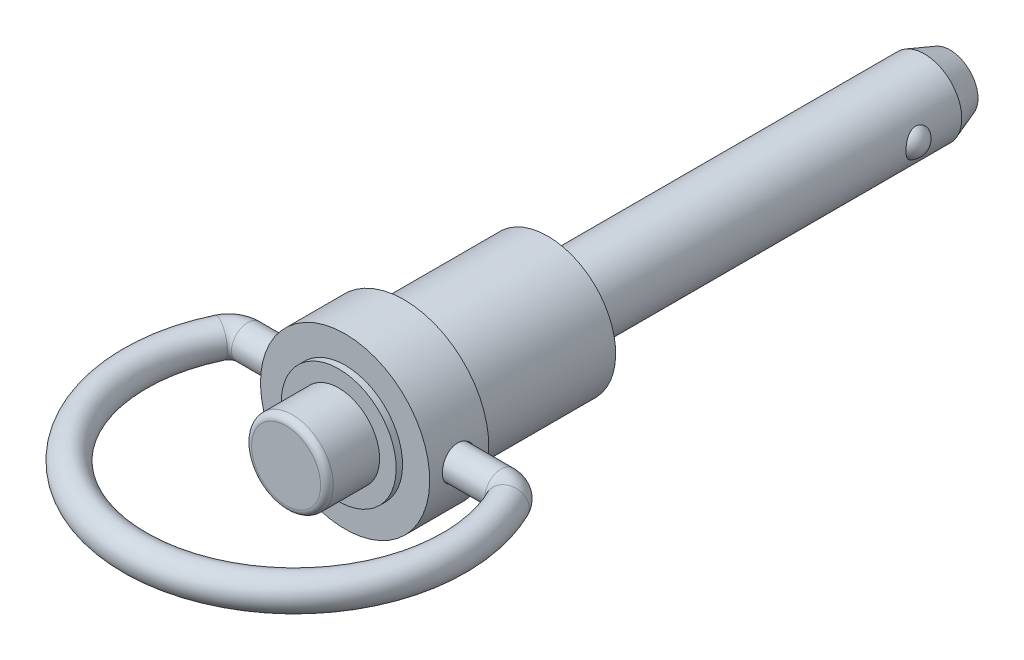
ISO-10303-21;
HEADER;
FILE_DESCRIPTION(('STEP AP214'),'2;1');
FILE_NAME('part.step','',(''),(''),'','','');
FILE_SCHEMA(('AUTOMOTIVE_DESIGN { 1 0 10303 214 1 1 1 1 }'));
ENDSEC;
DATA;
#1=APPLICATION_CONTEXT('core data for automotive mechanical design processes');
#2=APPLICATION_PROTOCOL_DEFINITION('international standard','automotive_design',2000,#1);
#3=PRODUCT_CONTEXT('',#1,'mechanical');
#4=PRODUCT('Part','Part','',(#3));
#5=PRODUCT_RELATED_PRODUCT_CATEGORY('part','',(#4));
#6=PRODUCT_DEFINITION_FORMATION('','',#4);
#7=PRODUCT_DEFINITION_CONTEXT('part definition',#1,'design');
#8=PRODUCT_DEFINITION('design','',#6,#7);
#9=PRODUCT_DEFINITION_SHAPE('','',#8);
#10=(LENGTH_UNIT() NAMED_UNIT(*) SI_UNIT(.MILLI.,.METRE.));
#11=(NAMED_UNIT(*) PLANE_ANGLE_UNIT() SI_UNIT($,.RADIAN.));
#12=(NAMED_UNIT(*) SI_UNIT($,.STERADIAN.) SOLID_ANGLE_UNIT());
#13=UNCERTAINTY_MEASURE_WITH_UNIT(LENGTH_MEASURE(1.E-05),#10,'distance_accuracy_value','');
#14=(GEOMETRIC_REPRESENTATION_CONTEXT(3) GLOBAL_UNCERTAINTY_ASSIGNED_CONTEXT((#13)) GLOBAL_UNIT_ASSIGNED_CONTEXT((#10,
#11,#12)) REPRESENTATION_CONTEXT('',''));
#15=CARTESIAN_POINT('',(0.,0.,0.));
#16=DIRECTION('',(0.,0.,1.));
#17=DIRECTION('',(1.,0.,0.));
#18=AXIS2_PLACEMENT_3D('',#15,#16,#17);
#19=CARTESIAN_POINT('',(0.,0.,-10.));
#20=DIRECTION('',(0.,0.,1.));
#21=DIRECTION('',(-0.810321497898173,-0.585985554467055,0.));
#22=AXIS2_PLACEMENT_3D('',#19,#20,#21);
#23=CYLINDRICAL_SURFACE('',#22,2.969895);
#24=CARTESIAN_POINT('',(0.,0.,0.));
#25=DIRECTION('',(0.,0.,-1.));
#26=DIRECTION('',(0.810321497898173,0.585985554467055,0.));
#27=AXIS2_PLACEMENT_3D('',#24,#25,#26);
#28=CIRCLE('',#27,2.969895);
#29=CARTESIAN_POINT('',(2.40656976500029,1.74031556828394,0.));
#30=VERTEX_POINT('',#29);
#31=EDGE_CURVE('E9',#30,#30,#28,.T.);
#32=ORIENTED_EDGE('',*,*,#31,.T.);
#33=EDGE_LOOP('',(#32));
#34=FACE_BOUND('',#33,.T.);
#35=CARTESIAN_POINT('',(0.,0.,-29.9644));
#36=DIRECTION('',(0.,0.,1.));
#37=DIRECTION('',(0.,-1.,0.));
#38=AXIS2_PLACEMENT_3D('',#35,#36,#37);
#39=CIRCLE('',#38,2.969895);
#40=CARTESIAN_POINT('',(0.,-2.969895,-29.9644));
#41=VERTEX_POINT('',#40);
#42=EDGE_CURVE('E270',#41,#41,#39,.T.);
#43=ORIENTED_EDGE('',*,*,#42,.T.);
#44=EDGE_LOOP('',(#43));
#45=FACE_BOUND('',#44,.T.);
#46=CARTESIAN_POINT('',(-2.969895,0.,-25.5227726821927));
#47=CARTESIAN_POINT('',(-2.96989215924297,-0.0648782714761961,-25.5227743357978));
#48=CARTESIAN_POINT('',(-2.96774890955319,-0.129810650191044,-25.5277431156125));
#49=CARTESIAN_POINT('',(-2.95937136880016,-0.257939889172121,-25.5476001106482));
#50=CARTESIAN_POINT('',(-2.95313126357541,-0.321134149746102,-25.5625024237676));
#51=CARTESIAN_POINT('',(-2.9371782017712,-0.443953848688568,-25.602129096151));
#52=CARTESIAN_POINT('',(-2.92746355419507,-0.503577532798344,-25.6268582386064));
#53=CARTESIAN_POINT('',(-2.90559229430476,-0.617388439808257,-25.6859024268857));
#54=CARTESIAN_POINT('',(-2.89343626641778,-0.671576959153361,-25.720215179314));
#55=CARTESIAN_POINT('',(-2.86839896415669,-0.771461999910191,-25.7970531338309));
#56=CARTESIAN_POINT('',(-2.85554234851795,-0.817332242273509,-25.8393595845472));
#57=CARTESIAN_POINT('',(-2.83045508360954,-0.900380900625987,-25.9319696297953));
#58=CARTESIAN_POINT('',(-2.8182241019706,-0.937563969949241,-25.9822689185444));
#59=CARTESIAN_POINT('',(-2.79711253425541,-0.998697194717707,-26.0848948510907));
#60=CARTESIAN_POINT('',(-2.78803232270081,-1.02352115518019,-26.1366580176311));
#61=CARTESIAN_POINT('',(-2.77311559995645,-1.06327998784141,-26.2442814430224));
#62=CARTESIAN_POINT('',(-2.76727569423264,-1.07822521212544,-26.3001373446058));
#63=CARTESIAN_POINT('',(-2.76016046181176,-1.09629924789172,-26.4072797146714));
#64=CARTESIAN_POINT('',(-2.75843254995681,-1.10060201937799,-26.4583402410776));
#65=CARTESIAN_POINT('',(-2.75840791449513,-1.10066500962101,-26.5604602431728));
#66=CARTESIAN_POINT('',(-2.76011003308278,-1.09642811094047,-26.6115197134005));
#67=CARTESIAN_POINT('',(-2.7665389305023,-1.08009599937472,-26.7091745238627));
#68=CARTESIAN_POINT('',(-2.77108985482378,-1.06845708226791,-26.7558592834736));
#69=CARTESIAN_POINT('',(-2.78255728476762,-1.03822483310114,-26.8466019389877));
#70=CARTESIAN_POINT('',(-2.78947408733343,-1.01963062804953,-26.8906595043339));
#71=CARTESIAN_POINT('',(-2.80532470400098,-0.975195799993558,-26.9770275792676));
#72=CARTESIAN_POINT('',(-2.81433263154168,-0.949077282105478,-27.0191808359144));
#73=CARTESIAN_POINT('',(-2.83331083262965,-0.890821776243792,-27.098843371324));
#74=CARTESIAN_POINT('',(-2.84328141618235,-0.858682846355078,-27.1363511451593));
#75=CARTESIAN_POINT('',(-2.86436272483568,-0.785676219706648,-27.2098152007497));
#76=CARTESIAN_POINT('',(-2.87548504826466,-0.744250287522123,-27.2452131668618));
#77=CARTESIAN_POINT('',(-2.89682746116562,-0.656290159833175,-27.3093141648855));
#78=CARTESIAN_POINT('',(-2.907046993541,-0.609752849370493,-27.338013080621));
#79=CARTESIAN_POINT('',(-2.92666611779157,-0.507798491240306,-27.3910016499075));
#80=CARTESIAN_POINT('',(-2.93587767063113,-0.45195949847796,-27.4145497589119));
#81=CARTESIAN_POINT('',(-2.95127762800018,-0.337032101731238,-27.4529672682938));
#82=CARTESIAN_POINT('',(-2.95746899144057,-0.277946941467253,-27.467845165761));
#83=CARTESIAN_POINT('',(-2.96452744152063,-0.182090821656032,-27.4846363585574));
#84=CARTESIAN_POINT('',(-2.96653391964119,-0.145868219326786,-27.4893558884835));
#85=CARTESIAN_POINT('',(-2.96921851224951,-0.0731028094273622,-27.4956518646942));
#86=CARTESIAN_POINT('',(-2.96989660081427,-0.0365599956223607,-27.4972282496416));
#87=CARTESIAN_POINT('',(-2.96989215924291,0.0648782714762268,-27.4972256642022));
#88=CARTESIAN_POINT('',(-2.96774890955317,0.129810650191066,-27.4922568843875));
#89=CARTESIAN_POINT('',(-2.95937136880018,0.257939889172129,-27.4723998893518));
#90=CARTESIAN_POINT('',(-2.95313126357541,0.321134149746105,-27.4574975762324));
#91=CARTESIAN_POINT('',(-2.9371782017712,0.443953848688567,-27.417870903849));
#92=CARTESIAN_POINT('',(-2.92746355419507,0.503577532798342,-27.3931417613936));
#93=CARTESIAN_POINT('',(-2.90559229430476,0.617388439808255,-27.3340975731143));
#94=CARTESIAN_POINT('',(-2.89343626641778,0.671576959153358,-27.299784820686));
#95=CARTESIAN_POINT('',(-2.86839896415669,0.771461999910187,-27.2229468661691));
#96=CARTESIAN_POINT('',(-2.85554234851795,0.817332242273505,-27.1806404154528));
#97=CARTESIAN_POINT('',(-2.83045508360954,0.900380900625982,-27.0880303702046));
#98=CARTESIAN_POINT('',(-2.8182241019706,0.937563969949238,-27.0377310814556));
#99=CARTESIAN_POINT('',(-2.79711253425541,0.998697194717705,-26.9351051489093));
#100=CARTESIAN_POINT('',(-2.78803232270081,1.02352115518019,-26.8833419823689));
#101=CARTESIAN_POINT('',(-2.77311559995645,1.06327998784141,-26.7757185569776));
#102=CARTESIAN_POINT('',(-2.76727569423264,1.07822521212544,-26.7198626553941));
#103=CARTESIAN_POINT('',(-2.76016046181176,1.09629924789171,-26.6127202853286));
#104=CARTESIAN_POINT('',(-2.75843254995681,1.10060201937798,-26.5616597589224));
#105=CARTESIAN_POINT('',(-2.75840791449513,1.10066500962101,-26.4595397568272));
#106=CARTESIAN_POINT('',(-2.76011003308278,1.09642811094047,-26.4084802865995));
#107=CARTESIAN_POINT('',(-2.7665389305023,1.08009599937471,-26.3108254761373));
#108=CARTESIAN_POINT('',(-2.77108985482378,1.06845708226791,-26.2641407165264));
#109=CARTESIAN_POINT('',(-2.78255728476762,1.03822483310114,-26.1733980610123));
#110=CARTESIAN_POINT('',(-2.78947408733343,1.01963062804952,-26.1293404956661));
#111=CARTESIAN_POINT('',(-2.80532470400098,0.975195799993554,-26.0429724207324));
#112=CARTESIAN_POINT('',(-2.81433263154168,0.949077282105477,-26.0008191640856));
#113=CARTESIAN_POINT('',(-2.83331083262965,0.89082177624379,-25.921156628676));
#114=CARTESIAN_POINT('',(-2.84328141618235,0.858682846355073,-25.8836488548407));
#115=CARTESIAN_POINT('',(-2.86436272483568,0.785676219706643,-25.8101847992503));
#116=CARTESIAN_POINT('',(-2.87548504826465,0.74425028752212,-25.7747868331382));
#117=CARTESIAN_POINT('',(-2.89682746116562,0.656290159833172,-25.7106858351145));
#118=CARTESIAN_POINT('',(-2.907046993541,0.609752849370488,-25.681986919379));
#119=CARTESIAN_POINT('',(-2.92666611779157,0.5077984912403,-25.6289983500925));
#120=CARTESIAN_POINT('',(-2.93587767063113,0.451959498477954,-25.6054502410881));
#121=CARTESIAN_POINT('',(-2.95127762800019,0.337032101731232,-25.5670327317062));
#122=CARTESIAN_POINT('',(-2.95746899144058,0.277946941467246,-25.552154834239));
#123=CARTESIAN_POINT('',(-2.96452744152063,0.182090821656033,-25.5353636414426));
#124=CARTESIAN_POINT('',(-2.96653391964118,0.145868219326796,-25.5306441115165));
#125=CARTESIAN_POINT('',(-2.96921851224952,0.073102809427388,-25.5243481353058));
#126=CARTESIAN_POINT('',(-2.9698966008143,0.0365599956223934,-25.5227717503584));
#127=CARTESIAN_POINT('',(-2.969895,0.,-25.5227726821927));
#128=B_SPLINE_CURVE_WITH_KNOTS('',3,(#46,#47,#48,#49,#50,#51,#52,#53,#54,#55,#56,#57,#58,#59,
#60,#61,#62,#63,#64,#65,#66,#67,#68,#69,#70,#71,#72,#73,#74,#75,#76,#77,#78,#79,#80,#81,#82,#83,
#84,#85,#86,#87,#88,#89,#90,#91,#92,#93,#94,#95,#96,#97,#98,#99,#100,#101,#102,#103,#104,#105,
#106,#107,#108,#109,#110,#111,#112,#113,#114,#115,#116,#117,#118,#119,#120,#121,#122,#123,#124,
#125,#126,#127),.UNSPECIFIED.,.T.,.F.,(4,2,2,2,2,2,2,2,2,2,2,2,2,2,2,2,2,2,2,2,2,2,2,2,2,2,2,2,
2,2,2,2,2,2,2,2,2,2,2,2,4),(0.,0.194504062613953,0.389284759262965,0.584160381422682,
0.778989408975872,0.969105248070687,1.1591190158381,1.33248939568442,1.50567780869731,
1.65868585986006,1.81164227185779,1.95597910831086,2.10033406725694,2.25091366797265,
2.40154192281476,2.56769449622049,2.73394889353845,2.91705115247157,3.09997366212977,
3.20957782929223,3.31918413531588,3.51368819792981,3.70846889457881,3.90334451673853,
4.09817354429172,4.28828938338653,4.47830315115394,4.65167353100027,4.82486194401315,
4.9778699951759,5.13082640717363,5.2751632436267,5.41951820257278,5.57009780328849,
5.7207260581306,5.88687863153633,6.05313302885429,6.23623528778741,6.41915779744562,
6.52876196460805,6.63836827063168),.UNSPECIFIED.);
#129=CARTESIAN_POINT('',(-2.969895,0.,-25.5227726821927));
#130=VERTEX_POINT('',#129);
#131=EDGE_CURVE('E267',#130,#130,#128,.T.);
#132=ORIENTED_EDGE('',*,*,#131,.T.);
#133=EDGE_LOOP('',(#132));
#134=FACE_BOUND('',#133,.T.);
#135=CARTESIAN_POINT('',(2.969895,0.,-25.5227187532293));
#136=CARTESIAN_POINT('',(2.96989215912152,0.064879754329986,-25.5227204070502));
#137=CARTESIAN_POINT('',(2.9677488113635,0.129813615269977,-25.5276893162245));
#138=CARTESIAN_POINT('',(2.95937088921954,0.257945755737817,-25.547546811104));
#139=CARTESIAN_POINT('',(2.95313050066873,0.321141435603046,-25.5624494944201));
#140=CARTESIAN_POINT('',(2.93717671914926,0.44396385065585,-25.6020770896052));
#141=CARTESIAN_POINT('',(2.927461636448,0.503588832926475,-25.6268067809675));
#142=CARTESIAN_POINT('',(2.90558938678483,0.617402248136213,-25.6858521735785));
#143=CARTESIAN_POINT('',(2.89343280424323,0.671591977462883,-25.7201655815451));
#144=CARTESIAN_POINT('',(2.86839420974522,0.771479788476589,-25.79700516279));
#145=CARTESIAN_POINT('',(2.85553685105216,0.817351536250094,-25.8393126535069));
#146=CARTESIAN_POINT('',(2.83044802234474,0.900403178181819,-25.9319248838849));
#147=CARTESIAN_POINT('',(2.81821622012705,0.937587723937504,-25.9822253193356));
#148=CARTESIAN_POINT('',(2.79710280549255,0.998724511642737,-26.084854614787));
#149=CARTESIAN_POINT('',(2.78802161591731,1.02355036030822,-26.1366201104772));
#150=CARTESIAN_POINT('',(2.77310306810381,1.06331271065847,-26.2442484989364));
#151=CARTESIAN_POINT('',(2.76726231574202,1.07825956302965,-26.3001070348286));
#152=CARTESIAN_POINT('',(2.76014564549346,1.09633656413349,-26.4072555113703));
#153=CARTESIAN_POINT('',(2.75841717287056,1.10064055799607,-26.4583195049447));
#154=CARTESIAN_POINT('',(2.75839177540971,1.10070545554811,-26.5604466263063));
#155=CARTESIAN_POINT('',(2.76009369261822,1.09646924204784,-26.6115097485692));
#156=CARTESIAN_POINT('',(2.76652257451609,1.08013788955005,-26.7091717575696));
#157=CARTESIAN_POINT('',(2.77107366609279,1.0684990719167,-26.7558600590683));
#158=CARTESIAN_POINT('',(2.78254175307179,1.038266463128,-26.8466097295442));
#159=CARTESIAN_POINT('',(2.78945904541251,1.01967179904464,-26.8906707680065));
#160=CARTESIAN_POINT('',(2.80531085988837,0.97523564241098,-26.9770453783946));
#161=CARTESIAN_POINT('',(2.81431949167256,0.949116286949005,-27.0192017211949));
#162=CARTESIAN_POINT('',(2.83329926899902,0.890858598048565,-27.0988701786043));
#163=CARTESIAN_POINT('',(2.84327072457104,0.858718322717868,-27.1363807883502));
#164=CARTESIAN_POINT('',(2.86435381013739,0.785708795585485,-27.2098499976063));
#165=CARTESIAN_POINT('',(2.87547704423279,0.744281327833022,-27.2452503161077));
#166=CARTESIAN_POINT('',(2.89682125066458,0.656317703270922,-27.3093556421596));
#167=CARTESIAN_POINT('',(2.90704166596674,0.609778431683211,-27.3380565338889));
#168=CARTESIAN_POINT('',(2.92666236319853,0.507820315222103,-27.3910483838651));
#169=CARTESIAN_POINT('',(2.93587462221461,0.451979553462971,-27.4145978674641));
#170=CARTESIAN_POINT('',(2.95127580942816,0.337048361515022,-27.4530177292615));
#171=CARTESIAN_POINT('',(2.95746769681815,0.277961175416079,-27.4678966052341));
#172=CARTESIAN_POINT('',(2.96452684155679,0.182100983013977,-27.4846891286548));
#173=CARTESIAN_POINT('',(2.96653354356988,0.145876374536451,-27.4894090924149));
#174=CARTESIAN_POINT('',(2.96921843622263,0.0731069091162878,-27.4957056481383));
#175=CARTESIAN_POINT('',(2.9698966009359,0.0365620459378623,-27.4972821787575));
#176=CARTESIAN_POINT('',(2.96989215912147,-0.06487975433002,-27.4972795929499));
#177=CARTESIAN_POINT('',(2.96774881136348,-0.129813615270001,-27.4923106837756));
#178=CARTESIAN_POINT('',(2.95937088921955,-0.257945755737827,-27.472453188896));
#179=CARTESIAN_POINT('',(2.95313050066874,-0.321141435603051,-27.4575505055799));
#180=CARTESIAN_POINT('',(2.93717671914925,-0.443963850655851,-27.4179229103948));
#181=CARTESIAN_POINT('',(2.927461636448,-0.503588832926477,-27.3931932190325));
#182=CARTESIAN_POINT('',(2.90558938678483,-0.617402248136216,-27.3341478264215));
#183=CARTESIAN_POINT('',(2.89343280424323,-0.671591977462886,-27.2998344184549));
#184=CARTESIAN_POINT('',(2.86839420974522,-0.771479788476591,-27.22299483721));
#185=CARTESIAN_POINT('',(2.85553685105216,-0.817351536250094,-27.1806873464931));
#186=CARTESIAN_POINT('',(2.83044802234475,-0.900403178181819,-27.0880751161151));
#187=CARTESIAN_POINT('',(2.81821622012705,-0.937587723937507,-27.0377746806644));
#188=CARTESIAN_POINT('',(2.79710280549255,-0.998724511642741,-26.935145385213));
#189=CARTESIAN_POINT('',(2.78802161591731,-1.02355036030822,-26.8833798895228));
#190=CARTESIAN_POINT('',(2.77310306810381,-1.06331271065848,-26.7757515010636));
#191=CARTESIAN_POINT('',(2.76726231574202,-1.07825956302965,-26.7198929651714));
#192=CARTESIAN_POINT('',(2.76014564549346,-1.09633656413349,-26.6127444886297));
#193=CARTESIAN_POINT('',(2.75841717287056,-1.10064055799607,-26.5616804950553));
#194=CARTESIAN_POINT('',(2.75839177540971,-1.10070545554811,-26.4595533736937));
#195=CARTESIAN_POINT('',(2.76009369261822,-1.09646924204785,-26.4084902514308));
#196=CARTESIAN_POINT('',(2.76652257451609,-1.08013788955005,-26.3108282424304));
#197=CARTESIAN_POINT('',(2.77107366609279,-1.0684990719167,-26.2641399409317));
#198=CARTESIAN_POINT('',(2.78254175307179,-1.038266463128,-26.1733902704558));
#199=CARTESIAN_POINT('',(2.78945904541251,-1.01967179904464,-26.1293292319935));
#200=CARTESIAN_POINT('',(2.80531085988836,-0.975235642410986,-26.0429546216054));
#201=CARTESIAN_POINT('',(2.81431949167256,-0.949116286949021,-26.0007982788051));
#202=CARTESIAN_POINT('',(2.83329926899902,-0.890858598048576,-25.9211298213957));
#203=CARTESIAN_POINT('',(2.84327072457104,-0.858718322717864,-25.8836192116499));
#204=CARTESIAN_POINT('',(2.86435381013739,-0.785708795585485,-25.8101500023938));
#205=CARTESIAN_POINT('',(2.87547704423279,-0.744281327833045,-25.7747496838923));
#206=CARTESIAN_POINT('',(2.89682125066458,-0.656317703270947,-25.7106443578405));
#207=CARTESIAN_POINT('',(2.90704166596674,-0.609778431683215,-25.6819434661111));
#208=CARTESIAN_POINT('',(2.92666236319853,-0.507820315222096,-25.628951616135));
#209=CARTESIAN_POINT('',(2.93587462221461,-0.451979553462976,-25.6054021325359));
#210=CARTESIAN_POINT('',(2.95127580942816,-0.337048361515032,-25.5669822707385));
#211=CARTESIAN_POINT('',(2.95746769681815,-0.277961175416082,-25.5521033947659));
#212=CARTESIAN_POINT('',(2.96452684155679,-0.182100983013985,-25.5353108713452));
#213=CARTESIAN_POINT('',(2.96653354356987,-0.145876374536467,-25.5305909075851));
#214=CARTESIAN_POINT('',(2.96921843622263,-0.0731069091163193,-25.5242943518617));
#215=CARTESIAN_POINT('',(2.96989660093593,-0.0365620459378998,-25.5227178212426));
#216=CARTESIAN_POINT('',(2.969895,0.,-25.5227187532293));
#217=B_SPLINE_CURVE_WITH_KNOTS('',3,(#135,#136,#137,#138,#139,#140,#141,#142,#143,#144,#145,
#146,#147,#148,#149,#150,#151,#152,#153,#154,#155,#156,#157,#158,#159,#160,#161,#162,#163,#164,
#165,#166,#167,#168,#169,#170,#171,#172,#173,#174,#175,#176,#177,#178,#179,#180,#181,#182,#183,
#184,#185,#186,#187,#188,#189,#190,#191,#192,#193,#194,#195,#196,#197,#198,#199,#200,#201,#202,
#203,#204,#205,#206,#207,#208,#209,#210,#211,#212,#213,#214,#215,#216),.UNSPECIFIED.,.T.,.F.,(4,
2,2,2,2,2,2,2,2,2,2,2,2,2,2,2,2,2,2,2,2,2,2,2,2,2,2,2,2,2,2,2,2,2,2,2,2,2,2,2,4),(0.,
0.194508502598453,0.389293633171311,0.584173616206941,0.77900700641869,0.969128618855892,
1.15914819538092,1.33252765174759,1.50572516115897,1.65874388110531,1.81171095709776,
1.95605797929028,2.10042312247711,2.25101209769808,2.4016497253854,2.56781072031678,
2.73407352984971,2.91718248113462,3.10011167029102,3.20972198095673,3.31933443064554,
3.51384293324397,3.70862806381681,3.90350804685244,4.09834143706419,4.28846304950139,
4.47848262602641,4.65186208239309,4.82505959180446,4.97807831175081,5.13104538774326,
5.27539240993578,5.4197575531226,5.57034652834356,5.72098415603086,5.88714515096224,
6.05340796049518,6.2365169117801,6.41944610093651,6.52905641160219,6.63866886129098),.UNSPECIFIED.);
#218=CARTESIAN_POINT('',(2.969895,0.,-25.5227187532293));
#219=VERTEX_POINT('',#218);
#220=EDGE_CURVE('E283',#219,#219,#217,.T.);
#221=ORIENTED_EDGE('',*,*,#220,.T.);
#222=EDGE_LOOP('',(#221));
#223=FACE_BOUND('',#222,.T.);
#224=ADVANCED_FACE('F14',(#34,#45,#134,#223),#23,.T.);
#225=CARTESIAN_POINT('',(0.,0.,20.828));
#226=DIRECTION('',(0.,0.,1.));
#227=DIRECTION('',(0.,-1.,0.));
#228=AXIS2_PLACEMENT_3D('',#225,#226,#227);
#229=PLANE('',#228);
#230=CARTESIAN_POINT('',(0.,0.,20.828));
#231=DIRECTION('',(0.,0.,-1.));
#232=DIRECTION('',(0.,1.,0.));
#233=AXIS2_PLACEMENT_3D('',#230,#231,#232);
#234=CIRCLE('',#233,2.7432);
#235=CARTESIAN_POINT('',(0.,2.7432,20.828));
#236=VERTEX_POINT('',#235);
#237=CARTESIAN_POINT('',(0.,-2.7432,20.828));
#238=VERTEX_POINT('',#237);
#239=EDGE_CURVE('E44',#236,#238,#234,.T.);
#240=ORIENTED_EDGE('',*,*,#239,.F.);
#241=CARTESIAN_POINT('',(0.,0.,20.828));
#242=DIRECTION('',(0.,0.,-1.));
#243=DIRECTION('',(0.,-1.,0.));
#244=AXIS2_PLACEMENT_3D('',#241,#242,#243);
#245=CIRCLE('',#244,2.7432);
#246=EDGE_CURVE('E38',#238,#236,#245,.T.);
#247=ORIENTED_EDGE('',*,*,#246,.F.);
#248=EDGE_LOOP('',(#240,#247));
#249=FACE_BOUND('',#248,.T.);
#250=ADVANCED_FACE('F43',(#249),#229,.T.);
#251=CARTESIAN_POINT('',(0.,0.,20.1422));
#252=DIRECTION('',(0.,1.,0.));
#253=DIRECTION('',(-1.,0.,0.));
#254=AXIS2_PLACEMENT_3D('',#251,#252,#253);
#255=TOROIDAL_SURFACE('',#254,12.7,1.2954);
#256=CARTESIAN_POINT('',(-11.4549005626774,0.,14.6581090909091));
#257=DIRECTION('',(-0.43181818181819,0.,0.901960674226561));
#258=DIRECTION('',(-0.901960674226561,0.,-0.43181818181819));
#259=AXIS2_PLACEMENT_3D('',#256,#257,#258);
#260=CIRCLE('',#259,1.2954);
#261=CARTESIAN_POINT('',(-12.6233004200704,0.,14.0987318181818));
#262=VERTEX_POINT('',#261);
#263=EDGE_CURVE('E229',#262,#262,#260,.F.);
#264=ORIENTED_EDGE('',*,*,#263,.F.);
#265=EDGE_LOOP('',(#264));
#266=FACE_BOUND('',#265,.T.);
#267=CARTESIAN_POINT('',(11.4549005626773,0.,14.658109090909));
#268=DIRECTION('',(-0.431818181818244,0.,-0.901960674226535));
#269=DIRECTION('',(0.901960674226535,0.,-0.431818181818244));
#270=AXIS2_PLACEMENT_3D('',#267,#268,#269);
#271=CIRCLE('',#270,1.2954);
#272=CARTESIAN_POINT('',(12.6233004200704,0.,14.0987318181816));
#273=VERTEX_POINT('',#272);
#274=EDGE_CURVE('E52',#273,#273,#271,.T.);
#275=ORIENTED_EDGE('',*,*,#274,.F.);
#276=EDGE_LOOP('',(#275));
#277=FACE_BOUND('',#276,.T.);
#278=ADVANCED_FACE('F73',(#266,#277),#255,.T.);
#279=CARTESIAN_POINT('',(0.,0.,20.32));
#280=DIRECTION('',(0.,0.,1.));
#281=DIRECTION('',(0.,-1.,0.));
#282=AXIS2_PLACEMENT_3D('',#279,#280,#281);
#283=TOROIDAL_SURFACE('',#282,2.7432,0.508);
#284=ORIENTED_EDGE('',*,*,#246,.T.);
#285=ORIENTED_EDGE('',*,*,#239,.T.);
#286=EDGE_LOOP('',(#284,#285));
#287=FACE_BOUND('',#286,.T.);
#288=CARTESIAN_POINT('',(0.,0.,20.32));
#289=DIRECTION('',(0.,0.,-1.));
#290=DIRECTION('',(0.,1.,0.));
#291=AXIS2_PLACEMENT_3D('',#288,#289,#290);
#292=CIRCLE('',#291,3.2512);
#293=CARTESIAN_POINT('',(0.,3.2512,20.32));
#294=VERTEX_POINT('',#293);
#295=EDGE_CURVE('E231',#294,#294,#292,.T.);
#296=ORIENTED_EDGE('',*,*,#295,.F.);
#297=EDGE_LOOP('',(#296));
#298=FACE_BOUND('',#297,.T.);
#299=ADVANCED_FACE('F50',(#287,#298),#283,.T.);
#300=CARTESIAN_POINT('',(10.0803124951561,0.,15.3162));
#301=DIRECTION('',(0.,1.,0.));
#302=DIRECTION('',(-1.,0.,0.));
#303=AXIS2_PLACEMENT_3D('',#300,#301,#302);
#304=TOROIDAL_SURFACE('',#303,1.524,1.2954);
#305=ORIENTED_EDGE('',*,*,#274,.T.);
#306=EDGE_LOOP('',(#305));
#307=FACE_BOUND('',#306,.T.);
#308=CARTESIAN_POINT('',(10.0803124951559,0.,13.7922));
#309=DIRECTION('',(1.,0.,0.));
#310=DIRECTION('',(0.,1.,0.));
#311=AXIS2_PLACEMENT_3D('',#308,#309,#310);
#312=CIRCLE('',#311,1.2954);
#313=CARTESIAN_POINT('',(10.0803124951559,1.2954,13.7922));
#314=VERTEX_POINT('',#313);
#315=EDGE_CURVE('E189',#314,#314,#312,.F.);
#316=ORIENTED_EDGE('',*,*,#315,.F.);
#317=EDGE_LOOP('',(#316));
#318=FACE_BOUND('',#317,.T.);
#319=ADVANCED_FACE('F72',(#307,#318),#304,.T.);
#320=CARTESIAN_POINT('',(-10.0803124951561,0.,15.3162));
#321=DIRECTION('',(0.,1.,0.));
#322=DIRECTION('',(-1.,0.,0.));
#323=AXIS2_PLACEMENT_3D('',#320,#321,#322);
#324=TOROIDAL_SURFACE('',#323,1.524,1.2954);
#325=CARTESIAN_POINT('',(-10.0803124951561,0.,13.7922));
#326=DIRECTION('',(1.,0.,0.));
#327=DIRECTION('',(0.,1.,0.));
#328=AXIS2_PLACEMENT_3D('',#325,#326,#327);
#329=CIRCLE('',#328,1.2954);
#330=CARTESIAN_POINT('',(-10.0803124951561,1.2954,13.7922));
#331=VERTEX_POINT('',#330);
#332=EDGE_CURVE('E185',#331,#331,#329,.T.);
#333=ORIENTED_EDGE('',*,*,#332,.F.);
#334=EDGE_LOOP('',(#333));
#335=FACE_BOUND('',#334,.T.);
#336=ORIENTED_EDGE('',*,*,#263,.T.);
#337=EDGE_LOOP('',(#336));
#338=FACE_BOUND('',#337,.T.);
#339=ADVANCED_FACE('F90',(#335,#338),#324,.T.);
#340=CARTESIAN_POINT('',(0.,0.,20.828));
#341=DIRECTION('',(0.,0.,-1.));
#342=DIRECTION('',(0.,1.,0.));
#343=AXIS2_PLACEMENT_3D('',#340,#341,#342);
#344=CYLINDRICAL_SURFACE('',#343,3.2512);
#345=CARTESIAN_POINT('',(0.,0.,16.637));
#346=DIRECTION('',(0.,0.,-1.));
#347=DIRECTION('',(0.,1.,0.));
#348=AXIS2_PLACEMENT_3D('',#345,#346,#347);
#349=CIRCLE('',#348,3.2512);
#350=CARTESIAN_POINT('',(0.,3.2512,16.637));
#351=VERTEX_POINT('',#350);
#352=EDGE_CURVE('E186',#351,#351,#349,.T.);
#353=ORIENTED_EDGE('',*,*,#352,.F.);
#354=EDGE_LOOP('',(#353));
#355=FACE_BOUND('',#354,.T.);
#356=ORIENTED_EDGE('',*,*,#295,.T.);
#357=EDGE_LOOP('',(#356));
#358=FACE_BOUND('',#357,.T.);
#359=ADVANCED_FACE('F92',(#355,#358),#344,.T.);
#360=CARTESIAN_POINT('',(-10.0803124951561,0.,13.7922));
#361=DIRECTION('',(1.,0.,0.));
#362=DIRECTION('',(0.,1.,0.));
#363=AXIS2_PLACEMENT_3D('',#360,#361,#362);
#364=CYLINDRICAL_SURFACE('',#363,1.2954);
#365=CARTESIAN_POINT('',(4.953,0.,13.7922));
#366=DIRECTION('',(1.,0.,0.));
#367=DIRECTION('',(0.,1.,0.));
#368=AXIS2_PLACEMENT_3D('',#365,#366,#367);
#369=CIRCLE('',#368,1.2954);
#370=CARTESIAN_POINT('',(4.953,1.2954,13.7922));
#371=VERTEX_POINT('',#370);
#372=EDGE_CURVE('E182',#371,#371,#369,.F.);
#373=ORIENTED_EDGE('',*,*,#372,.F.);
#374=EDGE_LOOP('',(#373));
#375=FACE_BOUND('',#374,.T.);
#376=ORIENTED_EDGE('',*,*,#315,.T.);
#377=EDGE_LOOP('',(#376));
#378=FACE_BOUND('',#377,.T.);
#379=ADVANCED_FACE('F95',(#375,#378),#364,.T.);
#380=CARTESIAN_POINT('',(-10.0803124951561,0.,13.7922));
#381=DIRECTION('',(1.,0.,0.));
#382=DIRECTION('',(0.,1.,0.));
#383=AXIS2_PLACEMENT_3D('',#380,#381,#382);
#384=CYLINDRICAL_SURFACE('',#383,1.2954);
#385=CARTESIAN_POINT('',(-4.953,0.,13.7922));
#386=DIRECTION('',(1.,0.,0.));
#387=DIRECTION('',(0.,1.,0.));
#388=AXIS2_PLACEMENT_3D('',#385,#386,#387);
#389=CIRCLE('',#388,1.2954);
#390=CARTESIAN_POINT('',(-4.953,1.2954,13.7922));
#391=VERTEX_POINT('',#390);
#392=EDGE_CURVE('E174',#391,#391,#389,.T.);
#393=ORIENTED_EDGE('',*,*,#392,.F.);
#394=EDGE_LOOP('',(#393));
#395=FACE_BOUND('',#394,.T.);
#396=ORIENTED_EDGE('',*,*,#332,.T.);
#397=EDGE_LOOP('',(#396));
#398=FACE_BOUND('',#397,.T.);
#399=ADVANCED_FACE('F102',(#395,#398),#384,.T.);
#400=CARTESIAN_POINT('',(4.572,0.,16.637));
#401=DIRECTION('',(0.,0.,1.));
#402=DIRECTION('',(0.,-1.,0.));
#403=AXIS2_PLACEMENT_3D('',#400,#401,#402);
#404=PLANE('',#403);
#405=ORIENTED_EDGE('',*,*,#352,.T.);
#406=EDGE_LOOP('',(#405));
#407=FACE_BOUND('',#406,.T.);
#408=CARTESIAN_POINT('',(0.,0.,16.637));
#409=DIRECTION('',(0.,0.,-1.));
#410=DIRECTION('',(0.,1.,0.));
#411=AXIS2_PLACEMENT_3D('',#408,#409,#410);
#412=CIRCLE('',#411,4.572);
#413=CARTESIAN_POINT('',(0.,4.572,16.637));
#414=VERTEX_POINT('',#413);
#415=EDGE_CURVE('E179',#414,#414,#412,.T.);
#416=ORIENTED_EDGE('',*,*,#415,.F.);
#417=EDGE_LOOP('',(#416));
#418=FACE_BOUND('',#417,.T.);
#419=ADVANCED_FACE('F104',(#407,#418),#404,.T.);
#420=CARTESIAN_POINT('',(4.953,0.,13.7922));
#421=DIRECTION('',(1.,0.,0.));
#422=DIRECTION('',(0.,1.,0.));
#423=AXIS2_PLACEMENT_3D('',#420,#421,#422);
#424=PLANE('',#423);
#425=CARTESIAN_POINT('',(4.953,0.,13.7922));
#426=DIRECTION('',(1.,0.,0.));
#427=DIRECTION('',(0.,1.,0.));
#428=AXIS2_PLACEMENT_3D('',#425,#426,#427);
#429=CIRCLE('',#428,1.3335);
#430=CARTESIAN_POINT('',(4.953,1.3335,13.7922));
#431=VERTEX_POINT('',#430);
#432=EDGE_CURVE('E171',#431,#431,#429,.T.);
#433=ORIENTED_EDGE('',*,*,#432,.T.);
#434=EDGE_LOOP('',(#433));
#435=FACE_BOUND('',#434,.T.);
#436=ORIENTED_EDGE('',*,*,#372,.T.);
#437=EDGE_LOOP('',(#436));
#438=FACE_BOUND('',#437,.T.);
#439=ADVANCED_FACE('F107',(#435,#438),#424,.T.);
#440=CARTESIAN_POINT('',(-4.953,0.,13.7922));
#441=DIRECTION('',(-1.,0.,0.));
#442=DIRECTION('',(0.,-1.,0.));
#443=AXIS2_PLACEMENT_3D('',#440,#441,#442);
#444=PLANE('',#443);
#445=CARTESIAN_POINT('',(-4.953,0.,13.7922));
#446=DIRECTION('',(-1.,0.,0.));
#447=DIRECTION('',(0.,-1.,0.));
#448=AXIS2_PLACEMENT_3D('',#445,#446,#447);
#449=CIRCLE('',#448,1.3335);
#450=CARTESIAN_POINT('',(-4.95299999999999,-1.33350000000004,13.7922));
#451=VERTEX_POINT('',#450);
#452=EDGE_CURVE('E141',#451,#451,#449,.T.);
#453=ORIENTED_EDGE('',*,*,#452,.T.);
#454=EDGE_LOOP('',(#453));
#455=FACE_BOUND('',#454,.T.);
#456=ORIENTED_EDGE('',*,*,#392,.T.);
#457=EDGE_LOOP('',(#456));
#458=FACE_BOUND('',#457,.T.);
#459=ADVANCED_FACE('F114',(#455,#458),#444,.T.);
#460=CARTESIAN_POINT('',(0.,0.,0.));
#461=DIRECTION('',(0.,0.,-1.));
#462=DIRECTION('',(0.,1.,0.));
#463=AXIS2_PLACEMENT_3D('',#460,#461,#462);
#464=CYLINDRICAL_SURFACE('',#463,4.572);
#465=ORIENTED_EDGE('',*,*,#415,.T.);
#466=EDGE_LOOP('',(#465));
#467=FACE_BOUND('',#466,.T.);
#468=CARTESIAN_POINT('',(0.,0.,16.129));
#469=DIRECTION('',(0.,0.,-1.));
#470=DIRECTION('',(0.,1.,0.));
#471=AXIS2_PLACEMENT_3D('',#468,#469,#470);
#472=CIRCLE('',#471,4.572);
#473=CARTESIAN_POINT('',(0.,4.572,16.129));
#474=VERTEX_POINT('',#473);
#475=EDGE_CURVE('E169',#474,#474,#472,.T.);
#476=ORIENTED_EDGE('',*,*,#475,.F.);
#477=EDGE_LOOP('',(#476));
#478=FACE_BOUND('',#477,.T.);
#479=ADVANCED_FACE('F116',(#467,#478),#464,.T.);
#480=CARTESIAN_POINT('',(4.953,0.,13.7922));
#481=DIRECTION('',(1.,0.,0.));
#482=DIRECTION('',(0.,1.,0.));
#483=AXIS2_PLACEMENT_3D('',#480,#481,#482);
#484=CYLINDRICAL_SURFACE('',#483,1.3335);
#485=CARTESIAN_POINT('',(6.59758582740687,1.3335,13.7922));
#486=CARTESIAN_POINT('',(6.59758765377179,1.333496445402,13.718166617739));
#487=CARTESIAN_POINT('',(6.59884669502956,1.3273080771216,13.6440410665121));
#488=CARTESIAN_POINT('',(6.60374356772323,1.30272126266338,13.4978267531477));
#489=CARTESIAN_POINT('',(6.60738612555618,1.28429855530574,13.4257423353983));
#490=CARTESIAN_POINT('',(6.61662138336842,1.23583426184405,13.28583488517));
#491=CARTESIAN_POINT('',(6.622211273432,1.20580941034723,13.2180058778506));
#492=CARTESIAN_POINT('',(6.63470762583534,1.13503345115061,13.0883707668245));
#493=CARTESIAN_POINT('',(6.64161365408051,1.09428587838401,13.0265626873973));
#494=CARTESIAN_POINT('',(6.6560731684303,1.0026092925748,12.9098323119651));
#495=CARTESIAN_POINT('',(6.66363369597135,0.951558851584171,12.8550062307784));
#496=CARTESIAN_POINT('',(6.6784886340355,0.840985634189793,12.7546347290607));
#497=CARTESIAN_POINT('',(6.68578301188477,0.781461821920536,12.7090904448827));
#498=CARTESIAN_POINT('',(6.69935837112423,0.65500409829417,12.6282103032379));
#499=CARTESIAN_POINT('',(6.70563018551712,0.588011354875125,12.5929647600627));
#500=CARTESIAN_POINT('',(6.7163755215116,0.448910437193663,12.5342656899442));
#501=CARTESIAN_POINT('',(6.72084922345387,0.376802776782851,12.5108109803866));
#502=CARTESIAN_POINT('',(6.72744504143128,0.230507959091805,12.4766555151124));
#503=CARTESIAN_POINT('',(6.72959681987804,0.156359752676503,12.4657937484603));
#504=CARTESIAN_POINT('',(6.73140875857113,0.00726425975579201,12.4566302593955));
#505=CARTESIAN_POINT('',(6.73106915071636,-0.0676829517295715,12.4583273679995));
#506=CARTESIAN_POINT('',(6.72795960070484,-0.215142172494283,12.4741110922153));
#507=CARTESIAN_POINT('',(6.725223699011,-0.287673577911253,12.4880241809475));
#508=CARTESIAN_POINT('',(6.71766729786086,-0.42935197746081,12.5275699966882));
#509=CARTESIAN_POINT('',(6.71284670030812,-0.498498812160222,12.5532032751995));
#510=CARTESIAN_POINT('',(6.701606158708,-0.63194301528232,12.6156242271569));
#511=CARTESIAN_POINT('',(6.69517643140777,-0.696207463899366,12.6524804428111));
#512=CARTESIAN_POINT('',(6.68142742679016,-0.817699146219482,12.7362475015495));
#513=CARTESIAN_POINT('',(6.67410811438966,-0.874926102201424,12.7831587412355));
#514=CARTESIAN_POINT('',(6.65924190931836,-0.981743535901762,12.8866477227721));
#515=CARTESIAN_POINT('',(6.65169326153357,-1.03118836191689,12.9433756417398));
#516=CARTESIAN_POINT('',(6.63733339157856,-1.11990778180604,13.06442219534));
#517=CARTESIAN_POINT('',(6.63052249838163,-1.1591778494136,13.1287441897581));
#518=CARTESIAN_POINT('',(6.61840508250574,-1.22647971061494,13.2633777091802));
#519=CARTESIAN_POINT('',(6.61310290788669,-1.25447911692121,13.3337058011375));
#520=CARTESIAN_POINT('',(6.60466715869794,-1.29816626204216,13.4781072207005));
#521=CARTESIAN_POINT('',(6.6015290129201,-1.31387996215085,13.5521722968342));
#522=CARTESIAN_POINT('',(6.59896792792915,-1.32664627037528,13.6543666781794));
#523=CARTESIAN_POINT('',(6.59845085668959,-1.3292142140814,13.6818643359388));
#524=CARTESIAN_POINT('',(6.59775946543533,-1.33264174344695,13.7369703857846));
#525=CARTESIAN_POINT('',(6.59758514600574,-1.33350132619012,13.7645787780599));
#526=CARTESIAN_POINT('',(6.59758765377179,-1.333496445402,13.866233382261));
#527=CARTESIAN_POINT('',(6.59884669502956,-1.3273080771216,13.9403589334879));
#528=CARTESIAN_POINT('',(6.60374356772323,-1.30272126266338,14.0865732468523));
#529=CARTESIAN_POINT('',(6.60738612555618,-1.28429855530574,14.1586576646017));
#530=CARTESIAN_POINT('',(6.61662138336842,-1.23583426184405,14.29856511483));
#531=CARTESIAN_POINT('',(6.622211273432,-1.20580941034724,14.3663941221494));
#532=CARTESIAN_POINT('',(6.63470762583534,-1.13503345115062,14.4960292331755));
#533=CARTESIAN_POINT('',(6.64161365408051,-1.09428587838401,14.5578373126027));
#534=CARTESIAN_POINT('',(6.6560731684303,-1.00260929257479,14.6745676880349));
#535=CARTESIAN_POINT('',(6.66363369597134,-0.951558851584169,14.7293937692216));
#536=CARTESIAN_POINT('',(6.6784886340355,-0.840985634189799,14.8297652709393));
#537=CARTESIAN_POINT('',(6.68578301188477,-0.781461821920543,14.8753095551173));
#538=CARTESIAN_POINT('',(6.69935837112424,-0.65500409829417,14.9561896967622));
#539=CARTESIAN_POINT('',(6.70563018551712,-0.588011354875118,14.9914352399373));
#540=CARTESIAN_POINT('',(6.7163755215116,-0.448910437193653,15.0501343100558));
#541=CARTESIAN_POINT('',(6.72084922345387,-0.376802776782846,15.0735890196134));
#542=CARTESIAN_POINT('',(6.72744504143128,-0.230507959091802,15.1077444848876));
#543=CARTESIAN_POINT('',(6.72959681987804,-0.156359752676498,15.1186062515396));
#544=CARTESIAN_POINT('',(6.73140875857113,-0.00726425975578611,15.1277697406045));
#545=CARTESIAN_POINT('',(6.73106915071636,0.0676829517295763,15.1260726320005));
#546=CARTESIAN_POINT('',(6.72795960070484,0.215142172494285,15.1102889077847));
#547=CARTESIAN_POINT('',(6.72522369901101,0.287673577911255,15.0963758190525));
#548=CARTESIAN_POINT('',(6.71766729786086,0.429351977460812,15.0568300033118));
#549=CARTESIAN_POINT('',(6.71284670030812,0.498498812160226,15.0311967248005));
#550=CARTESIAN_POINT('',(6.701606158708,0.631943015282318,14.9687757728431));
#551=CARTESIAN_POINT('',(6.69517643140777,0.696207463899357,14.9319195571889));
#552=CARTESIAN_POINT('',(6.68142742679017,0.817699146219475,14.8481524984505));
#553=CARTESIAN_POINT('',(6.67410811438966,0.874926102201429,14.8012412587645));
#554=CARTESIAN_POINT('',(6.65924190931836,0.981743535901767,14.6977522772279));
#555=CARTESIAN_POINT('',(6.65169326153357,1.03118836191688,14.6410243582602));
#556=CARTESIAN_POINT('',(6.63733339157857,1.11990778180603,14.51997780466));
#557=CARTESIAN_POINT('',(6.63052249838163,1.1591778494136,14.4556558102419));
#558=CARTESIAN_POINT('',(6.61840508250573,1.22647971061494,14.3210222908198));
#559=CARTESIAN_POINT('',(6.61310290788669,1.25447911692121,14.2506941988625));
#560=CARTESIAN_POINT('',(6.60466715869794,1.29816626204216,14.1062927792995));
#561=CARTESIAN_POINT('',(6.6015290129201,1.31387996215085,14.0322277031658));
#562=CARTESIAN_POINT('',(6.59896792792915,1.32664627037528,13.9300333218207));
#563=CARTESIAN_POINT('',(6.59845085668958,1.3292142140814,13.9025356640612));
#564=CARTESIAN_POINT('',(6.59775946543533,1.33264174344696,13.8474296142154));
#565=CARTESIAN_POINT('',(6.59758514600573,1.33350132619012,13.8198212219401));
#566=CARTESIAN_POINT('',(6.59758582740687,1.3335,13.7922));
#567=B_SPLINE_CURVE_WITH_KNOTS('',3,(#485,#486,#487,#488,#489,#490,#491,#492,#493,#494,#495,
#496,#497,#498,#499,#500,#501,#502,#503,#504,#505,#506,#507,#508,#509,#510,#511,#512,#513,#514,
#515,#516,#517,#518,#519,#520,#521,#522,#523,#524,#525,#526,#527,#528,#529,#530,#531,#532,#533,
#534,#535,#536,#537,#538,#539,#540,#541,#542,#543,#544,#545,#546,#547,#548,#549,#550,#551,#552,
#553,#554,#555,#556,#557,#558,#559,#560,#561,#562,#563,#564,#565,#566),.UNSPECIFIED.,.T.,.F.,(4,
2,2,2,2,2,2,2,2,2,2,2,2,2,2,2,2,2,2,2,2,2,2,2,2,2,2,2,2,2,2,2,2,2,2,2,2,2,2,2,4),(0.,
0.221994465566,0.444430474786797,0.666546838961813,0.888590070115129,1.11342160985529,
1.33828065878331,1.56505617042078,1.79180893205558,2.01562934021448,2.23942891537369,
2.46009995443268,2.68078137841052,2.90283856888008,3.12490451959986,3.3507291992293,
3.5766541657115,3.80322379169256,4.02931334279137,4.11213743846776,4.19496167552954,
4.41695614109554,4.63939215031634,4.86150851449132,5.08355174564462,5.30838328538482,
5.53324233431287,5.76001784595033,5.98677060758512,6.21059101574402,6.43439059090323,
6.65506162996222,6.87574305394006,7.09780024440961,7.31986619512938,7.54569087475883,
7.77161584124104,7.99818546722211,8.22427501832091,8.3070991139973,8.38992335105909),.UNSPECIFIED.);
#568=CARTESIAN_POINT('',(6.59758582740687,1.3335,13.7922));
#569=VERTEX_POINT('',#568);
#570=EDGE_CURVE('E132',#569,#569,#567,.T.);
#571=ORIENTED_EDGE('',*,*,#570,.F.);
#572=EDGE_LOOP('',(#571));
#573=FACE_BOUND('',#572,.T.);
#574=ORIENTED_EDGE('',*,*,#432,.F.);
#575=EDGE_LOOP('',(#574));
#576=FACE_BOUND('',#575,.T.);
#577=ADVANCED_FACE('F119',(#573,#576),#484,.F.);
#578=CARTESIAN_POINT('',(-4.953,0.,13.7922));
#579=DIRECTION('',(-1.,0.,0.));
#580=DIRECTION('',(0.,-1.,0.));
#581=AXIS2_PLACEMENT_3D('',#578,#579,#580);
#582=CYLINDRICAL_SURFACE('',#581,1.3335);
#583=CARTESIAN_POINT('',(-6.59758582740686,-1.33350000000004,13.7922));
#584=CARTESIAN_POINT('',(-6.59758765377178,-1.33349644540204,13.718166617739));
#585=CARTESIAN_POINT('',(-6.59884669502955,-1.32730807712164,13.6440410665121));
#586=CARTESIAN_POINT('',(-6.60374356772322,-1.30272126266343,13.4978267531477));
#587=CARTESIAN_POINT('',(-6.60738612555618,-1.28429855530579,13.4257423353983));
#588=CARTESIAN_POINT('',(-6.61662138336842,-1.23583426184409,13.28583488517));
#589=CARTESIAN_POINT('',(-6.62221127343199,-1.20580941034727,13.2180058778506));
#590=CARTESIAN_POINT('',(-6.63470762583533,-1.13503345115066,13.0883707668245));
#591=CARTESIAN_POINT('',(-6.64161365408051,-1.09428587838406,13.0265626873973));
#592=CARTESIAN_POINT('',(-6.6560731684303,-1.00260929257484,12.9098323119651));
#593=CARTESIAN_POINT('',(-6.66363369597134,-0.951558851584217,12.8550062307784));
#594=CARTESIAN_POINT('',(-6.67848863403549,-0.84098563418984,12.7546347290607));
#595=CARTESIAN_POINT('',(-6.68578301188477,-0.781461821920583,12.7090904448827));
#596=CARTESIAN_POINT('',(-6.69935837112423,-0.655004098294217,12.6282103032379));
#597=CARTESIAN_POINT('',(-6.70563018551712,-0.588011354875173,12.5929647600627));
#598=CARTESIAN_POINT('',(-6.71637552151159,-0.448910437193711,12.5342656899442));
#599=CARTESIAN_POINT('',(-6.72084922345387,-0.376802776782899,12.5108109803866));
#600=CARTESIAN_POINT('',(-6.72744504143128,-0.230507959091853,12.4766555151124));
#601=CARTESIAN_POINT('',(-6.72959681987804,-0.156359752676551,12.4657937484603));
#602=CARTESIAN_POINT('',(-6.73140875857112,-0.00726425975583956,12.4566302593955));
#603=CARTESIAN_POINT('',(-6.73106915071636,0.0676829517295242,12.4583273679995));
#604=CARTESIAN_POINT('',(-6.72795960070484,0.215142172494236,12.4741110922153));
#605=CARTESIAN_POINT('',(-6.72522369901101,0.287673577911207,12.4880241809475));
#606=CARTESIAN_POINT('',(-6.71766729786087,0.429351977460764,12.5275699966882));
#607=CARTESIAN_POINT('',(-6.71284670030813,0.498498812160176,12.5532032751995));
#608=CARTESIAN_POINT('',(-6.70160615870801,0.631943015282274,12.6156242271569));
#609=CARTESIAN_POINT('',(-6.69517643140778,0.69620746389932,12.6524804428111));
#610=CARTESIAN_POINT('',(-6.68142742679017,0.817699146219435,12.7362475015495));
#611=CARTESIAN_POINT('',(-6.67410811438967,0.874926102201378,12.7831587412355));
#612=CARTESIAN_POINT('',(-6.65924190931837,0.981743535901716,12.8866477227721));
#613=CARTESIAN_POINT('',(-6.65169326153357,1.03118836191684,12.9433756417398));
#614=CARTESIAN_POINT('',(-6.63733339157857,1.11990778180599,13.06442219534));
#615=CARTESIAN_POINT('',(-6.63052249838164,1.15917784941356,13.1287441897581));
#616=CARTESIAN_POINT('',(-6.61840508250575,1.22647971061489,13.2633777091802));
#617=CARTESIAN_POINT('',(-6.6131029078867,1.25447911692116,13.3337058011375));
#618=CARTESIAN_POINT('',(-6.60466715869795,1.29816626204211,13.4781072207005));
#619=CARTESIAN_POINT('',(-6.60152901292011,1.3138799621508,13.5521722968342));
#620=CARTESIAN_POINT('',(-6.59896792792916,1.32664627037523,13.6543666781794));
#621=CARTESIAN_POINT('',(-6.59845085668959,1.32921421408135,13.6818643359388));
#622=CARTESIAN_POINT('',(-6.59775946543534,1.33264174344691,13.7369703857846));
#623=CARTESIAN_POINT('',(-6.59758514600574,1.33350132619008,13.7645787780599));
#624=CARTESIAN_POINT('',(-6.5975876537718,1.33349644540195,13.866233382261));
#625=CARTESIAN_POINT('',(-6.59884669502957,1.32730807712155,13.9403589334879));
#626=CARTESIAN_POINT('',(-6.60374356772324,1.30272126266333,14.0865732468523));
#627=CARTESIAN_POINT('',(-6.60738612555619,1.28429855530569,14.1586576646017));
#628=CARTESIAN_POINT('',(-6.61662138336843,1.235834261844,14.29856511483));
#629=CARTESIAN_POINT('',(-6.62221127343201,1.20580941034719,14.3663941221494));
#630=CARTESIAN_POINT('',(-6.63470762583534,1.13503345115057,14.4960292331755));
#631=CARTESIAN_POINT('',(-6.64161365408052,1.09428587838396,14.5578373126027));
#632=CARTESIAN_POINT('',(-6.65607316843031,1.00260929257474,14.6745676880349));
#633=CARTESIAN_POINT('',(-6.66363369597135,0.95155885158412,14.7293937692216));
#634=CARTESIAN_POINT('',(-6.67848863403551,0.840985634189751,14.8297652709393));
#635=CARTESIAN_POINT('',(-6.68578301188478,0.781461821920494,14.8753095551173));
#636=CARTESIAN_POINT('',(-6.69935837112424,0.655004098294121,14.9561896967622));
#637=CARTESIAN_POINT('',(-6.70563018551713,0.58801135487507,14.9914352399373));
#638=CARTESIAN_POINT('',(-6.7163755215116,0.448910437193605,15.0501343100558));
#639=CARTESIAN_POINT('',(-6.72084922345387,0.376802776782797,15.0735890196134));
#640=CARTESIAN_POINT('',(-6.72744504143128,0.230507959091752,15.1077444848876));
#641=CARTESIAN_POINT('',(-6.72959681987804,0.156359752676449,15.1186062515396));
#642=CARTESIAN_POINT('',(-6.73140875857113,0.0072642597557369,15.1277697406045));
#643=CARTESIAN_POINT('',(-6.73106915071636,-0.0676829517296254,15.1260726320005));
#644=CARTESIAN_POINT('',(-6.72795960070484,-0.215142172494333,15.1102889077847));
#645=CARTESIAN_POINT('',(-6.725223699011,-0.287673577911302,15.0963758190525));
#646=CARTESIAN_POINT('',(-6.71766729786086,-0.42935197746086,15.0568300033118));
#647=CARTESIAN_POINT('',(-6.71284670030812,-0.498498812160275,15.0311967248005));
#648=CARTESIAN_POINT('',(-6.701606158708,-0.631943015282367,14.9687757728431));
#649=CARTESIAN_POINT('',(-6.69517643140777,-0.696207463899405,14.9319195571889));
#650=CARTESIAN_POINT('',(-6.68142742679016,-0.817699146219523,14.8481524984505));
#651=CARTESIAN_POINT('',(-6.67410811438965,-0.874926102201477,14.8012412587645));
#652=CARTESIAN_POINT('',(-6.65924190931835,-0.981743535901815,14.6977522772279));
#653=CARTESIAN_POINT('',(-6.65169326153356,-1.03118836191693,14.6410243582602));
#654=CARTESIAN_POINT('',(-6.63733339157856,-1.11990778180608,14.51997780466));
#655=CARTESIAN_POINT('',(-6.63052249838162,-1.15917784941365,14.4556558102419));
#656=CARTESIAN_POINT('',(-6.61840508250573,-1.22647971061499,14.3210222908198));
#657=CARTESIAN_POINT('',(-6.61310290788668,-1.25447911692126,14.2506941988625));
#658=CARTESIAN_POINT('',(-6.60466715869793,-1.2981662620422,14.1062927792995));
#659=CARTESIAN_POINT('',(-6.60152901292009,-1.31387996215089,14.0322277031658));
#660=CARTESIAN_POINT('',(-6.59896792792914,-1.32664627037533,13.9300333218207));
#661=CARTESIAN_POINT('',(-6.59845085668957,-1.32921421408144,13.9025356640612));
#662=CARTESIAN_POINT('',(-6.59775946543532,-1.332641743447,13.8474296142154));
#663=CARTESIAN_POINT('',(-6.59758514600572,-1.33350132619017,13.8198212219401));
#664=CARTESIAN_POINT('',(-6.59758582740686,-1.33350000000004,13.7922));
#665=B_SPLINE_CURVE_WITH_KNOTS('',3,(#583,#584,#585,#586,#587,#588,#589,#590,#591,#592,#593,
#594,#595,#596,#597,#598,#599,#600,#601,#602,#603,#604,#605,#606,#607,#608,#609,#610,#611,#612,
#613,#614,#615,#616,#617,#618,#619,#620,#621,#622,#623,#624,#625,#626,#627,#628,#629,#630,#631,
#632,#633,#634,#635,#636,#637,#638,#639,#640,#641,#642,#643,#644,#645,#646,#647,#648,#649,#650,
#651,#652,#653,#654,#655,#656,#657,#658,#659,#660,#661,#662,#663,#664),.UNSPECIFIED.,.T.,.F.,(4,
2,2,2,2,2,2,2,2,2,2,2,2,2,2,2,2,2,2,2,2,2,2,2,2,2,2,2,2,2,2,2,2,2,2,2,2,2,2,2,4),(0.,
0.221994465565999,0.444430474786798,0.66654683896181,0.88859007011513,1.11342160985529,
1.33828065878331,1.56505617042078,1.79180893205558,2.01562934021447,2.23942891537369,
2.46009995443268,2.68078137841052,2.90283856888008,3.12490451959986,3.3507291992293,
3.5766541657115,3.80322379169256,4.02931334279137,4.11213743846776,4.19496167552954,
4.41695614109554,4.63939215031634,4.86150851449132,5.08355174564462,5.30838328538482,
5.53324233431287,5.76001784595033,5.98677060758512,6.21059101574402,6.43439059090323,
6.65506162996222,6.87574305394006,7.0978002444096,7.31986619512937,7.54569087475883,
7.77161584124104,7.99818546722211,8.22427501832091,8.3070991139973,8.38992335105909),.UNSPECIFIED.);
#666=CARTESIAN_POINT('',(-6.59758582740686,-1.33350000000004,13.7922));
#667=VERTEX_POINT('',#666);
#668=EDGE_CURVE('E153',#667,#667,#665,.T.);
#669=ORIENTED_EDGE('',*,*,#668,.F.);
#670=EDGE_LOOP('',(#669));
#671=FACE_BOUND('',#670,.T.);
#672=ORIENTED_EDGE('',*,*,#452,.F.);
#673=EDGE_LOOP('',(#672));
#674=FACE_BOUND('',#673,.T.);
#675=ADVANCED_FACE('F127',(#671,#674),#582,.F.);
#676=CARTESIAN_POINT('',(6.731,0.,16.129));
#677=DIRECTION('',(0.,0.,1.));
#678=DIRECTION('',(0.,-1.,0.));
#679=AXIS2_PLACEMENT_3D('',#676,#677,#678);
#680=PLANE('',#679);
#681=CARTESIAN_POINT('',(0.,0.,16.129));
#682=DIRECTION('',(0.,0.,-1.));
#683=DIRECTION('',(0.,1.,0.));
#684=AXIS2_PLACEMENT_3D('',#681,#682,#683);
#685=CIRCLE('',#684,6.731);
#686=CARTESIAN_POINT('',(0.,6.731,16.129));
#687=VERTEX_POINT('',#686);
#688=EDGE_CURVE('E140',#687,#687,#685,.T.);
#689=ORIENTED_EDGE('',*,*,#688,.F.);
#690=EDGE_LOOP('',(#689));
#691=FACE_BOUND('',#690,.T.);
#692=ORIENTED_EDGE('',*,*,#475,.T.);
#693=EDGE_LOOP('',(#692));
#694=FACE_BOUND('',#693,.T.);
#695=ADVANCED_FACE('F129',(#691,#694),#680,.T.);
#696=CARTESIAN_POINT('',(0.,0.,0.));
#697=DIRECTION('',(0.,0.,-1.));
#698=DIRECTION('',(0.,1.,0.));
#699=AXIS2_PLACEMENT_3D('',#696,#697,#698);
#700=CYLINDRICAL_SURFACE('',#699,6.731);
#701=ORIENTED_EDGE('',*,*,#688,.T.);
#702=EDGE_LOOP('',(#701));
#703=FACE_BOUND('',#702,.T.);
#704=ORIENTED_EDGE('',*,*,#668,.T.);
#705=EDGE_LOOP('',(#704));
#706=FACE_BOUND('',#705,.T.);
#707=CARTESIAN_POINT('',(0.,0.,11.43));
#708=DIRECTION('',(0.,0.,-1.));
#709=DIRECTION('',(0.,1.,0.));
#710=AXIS2_PLACEMENT_3D('',#707,#708,#709);
#711=CIRCLE('',#710,6.731);
#712=CARTESIAN_POINT('',(0.,6.731,11.43));
#713=VERTEX_POINT('',#712);
#714=EDGE_CURVE('E60',#713,#713,#711,.T.);
#715=ORIENTED_EDGE('',*,*,#714,.F.);
#716=EDGE_LOOP('',(#715));
#717=FACE_BOUND('',#716,.T.);
#718=ORIENTED_EDGE('',*,*,#570,.T.);
#719=EDGE_LOOP('',(#718));
#720=FACE_BOUND('',#719,.T.);
#721=ADVANCED_FACE('F143',(#703,#706,#717,#720),#700,.T.);
#722=CARTESIAN_POINT('',(5.7785,0.,11.43));
#723=DIRECTION('',(0.,0.,-1.));
#724=DIRECTION('',(0.,1.,0.));
#725=AXIS2_PLACEMENT_3D('',#722,#723,#724);
#726=PLANE('',#725);
#727=CARTESIAN_POINT('',(0.,0.,11.43));
#728=DIRECTION('',(0.,0.,-1.));
#729=DIRECTION('',(0.,1.,0.));
#730=AXIS2_PLACEMENT_3D('',#727,#728,#729);
#731=CIRCLE('',#730,5.7785);
#732=CARTESIAN_POINT('',(0.,-5.7785,11.43));
#733=VERTEX_POINT('',#732);
#734=CARTESIAN_POINT('',(0.,5.7785,11.43));
#735=VERTEX_POINT('',#734);
#736=EDGE_CURVE('E161',#733,#735,#731,.F.);
#737=ORIENTED_EDGE('',*,*,#736,.T.);
#738=CARTESIAN_POINT('',(0.,0.,11.43));
#739=DIRECTION('',(0.,0.,-1.));
#740=DIRECTION('',(0.,-1.,0.));
#741=AXIS2_PLACEMENT_3D('',#738,#739,#740);
#742=CIRCLE('',#741,5.7785);
#743=EDGE_CURVE('E29',#735,#733,#742,.F.);
#744=ORIENTED_EDGE('',*,*,#743,.T.);
#745=EDGE_LOOP('',(#737,#744));
#746=FACE_BOUND('',#745,.T.);
#747=ORIENTED_EDGE('',*,*,#714,.T.);
#748=EDGE_LOOP('',(#747));
#749=FACE_BOUND('',#748,.T.);
#750=ADVANCED_FACE('F147',(#746,#749),#726,.T.);
#751=CARTESIAN_POINT('',(0.,0.,11.049));
#752=DIRECTION('',(0.,0.,-1.));
#753=DIRECTION('',(0.,1.,0.));
#754=AXIS2_PLACEMENT_3D('',#751,#752,#753);
#755=TOROIDAL_SURFACE('',#754,5.7785,0.381);
#756=ORIENTED_EDGE('',*,*,#743,.F.);
#757=ORIENTED_EDGE('',*,*,#736,.F.);
#758=EDGE_LOOP('',(#756,#757));
#759=FACE_BOUND('',#758,.T.);
#760=CARTESIAN_POINT('',(0.,0.,11.049));
#761=DIRECTION('',(0.,0.,-1.));
#762=DIRECTION('',(0.,1.,0.));
#763=AXIS2_PLACEMENT_3D('',#760,#761,#762);
#764=CIRCLE('',#763,5.3975);
#765=CARTESIAN_POINT('',(0.,5.3975,11.049));
#766=VERTEX_POINT('',#765);
#767=EDGE_CURVE('E22',#766,#766,#764,.T.);
#768=ORIENTED_EDGE('',*,*,#767,.F.);
#769=EDGE_LOOP('',(#768));
#770=FACE_BOUND('',#769,.T.);
#771=ADVANCED_FACE('F195',(#759,#770),#755,.F.);
#772=CARTESIAN_POINT('',(0.,0.,0.));
#773=DIRECTION('',(0.,0.,-1.));
#774=DIRECTION('',(0.,1.,0.));
#775=AXIS2_PLACEMENT_3D('',#772,#773,#774);
#776=CYLINDRICAL_SURFACE('',#775,5.3975);
#777=ORIENTED_EDGE('',*,*,#767,.T.);
#778=EDGE_LOOP('',(#777));
#779=FACE_BOUND('',#778,.T.);
#780=CARTESIAN_POINT('',(0.,0.,0.));
#781=DIRECTION('',(0.,0.,-1.));
#782=DIRECTION('',(0.,1.,0.));
#783=AXIS2_PLACEMENT_3D('',#780,#781,#782);
#784=CIRCLE('',#783,5.3975);
#785=CARTESIAN_POINT('',(0.,5.3975,0.));
#786=VERTEX_POINT('',#785);
#787=EDGE_CURVE('E46',#786,#786,#784,.T.);
#788=ORIENTED_EDGE('',*,*,#787,.F.);
#789=EDGE_LOOP('',(#788));
#790=FACE_BOUND('',#789,.T.);
#791=ADVANCED_FACE('F204',(#779,#790),#776,.T.);
#792=CARTESIAN_POINT('',(0.,0.,0.));
#793=DIRECTION('',(0.,0.,-1.));
#794=DIRECTION('',(0.,1.,0.));
#795=AXIS2_PLACEMENT_3D('',#792,#793,#794);
#796=PLANE('',#795);
#797=ORIENTED_EDGE('',*,*,#787,.T.);
#798=EDGE_LOOP('',(#797));
#799=FACE_BOUND('',#798,.T.);
#800=ORIENTED_EDGE('',*,*,#31,.F.);
#801=EDGE_LOOP('',(#800));
#802=FACE_BOUND('',#801,.T.);
#803=ADVANCED_FACE('F205',(#799,#802),#796,.T.);
#804=CARTESIAN_POINT('',(2.23030748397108,0.,-31.9964));
#805=DIRECTION('',(0.,0.,1.));
#806=DIRECTION('',(0.,-1.,0.));
#807=AXIS2_PLACEMENT_3D('',#804,#805,#806);
#808=PLANE('',#807);
#809=CARTESIAN_POINT('',(0.,0.,-31.9963999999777));
#810=DIRECTION('',(0.,0.,1.));
#811=DIRECTION('',(0.,-1.,0.));
#812=AXIS2_PLACEMENT_3D('',#809,#810,#811);
#813=CIRCLE('',#812,2.23030748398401);
#814=CARTESIAN_POINT('',(0.,-2.23030748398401,-31.9963999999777));
#815=VERTEX_POINT('',#814);
#816=EDGE_CURVE('E273',#815,#815,#813,.T.);
#817=ORIENTED_EDGE('',*,*,#816,.F.);
#818=EDGE_LOOP('',(#817));
#819=FACE_BOUND('',#818,.T.);
#820=ADVANCED_FACE('F245',(#819),#808,.F.);
#821=CARTESIAN_POINT('',(2.304415,0.,-26.51));
#822=DIRECTION('',(0.,0.,1.));
#823=DIRECTION('',(1.,0.,0.));
#824=AXIS2_PLACEMENT_3D('',#821,#822,#823);
#825=SPHERICAL_SURFACE('',#824,1.190625);
#826=ORIENTED_EDGE('',*,*,#220,.F.);
#827=EDGE_LOOP('',(#826));
#828=FACE_BOUND('',#827,.T.);
#829=ADVANCED_FACE('F258',(#828),#825,.T.);
#830=CARTESIAN_POINT('',(-2.304335,0.,-26.51));
#831=DIRECTION('',(0.,0.,1.));
#832=DIRECTION('',(1.,0.,0.));
#833=AXIS2_PLACEMENT_3D('',#830,#831,#832);
#834=SPHERICAL_SURFACE('',#833,1.190625);
#835=ORIENTED_EDGE('',*,*,#131,.F.);
#836=EDGE_LOOP('',(#835));
#837=FACE_BOUND('',#836,.T.);
#838=ADVANCED_FACE('F298',(#837),#834,.T.);
#839=CARTESIAN_POINT('',(0.,0.,-29.9643999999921));
#840=DIRECTION('',(0.,0.,1.));
#841=DIRECTION('',(0.,-1.,0.));
#842=AXIS2_PLACEMENT_3D('',#839,#840,#841);
#843=CONICAL_SURFACE('',#842,2.96989500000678,0.349065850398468);
#844=ORIENTED_EDGE('',*,*,#816,.T.);
#845=EDGE_LOOP('',(#844));
#846=FACE_BOUND('',#845,.T.);
#847=ORIENTED_EDGE('',*,*,#42,.F.);
#848=EDGE_LOOP('',(#847));
#849=FACE_BOUND('',#848,.T.);
#850=ADVANCED_FACE('F303',(#846,#849),#843,.T.);
#851=CLOSED_SHELL('',(#224,#250,#278,#299,#319,#339,#359,#379,#399,#419,#439,#459,#479,#577,
#675,#695,#721,#750,#771,#791,#803,#820,#829,#838,#850));
#852=MANIFOLD_SOLID_BREP('B1',#851);
#853=ADVANCED_BREP_SHAPE_REPRESENTATION('',(#18,#852),#14);
#854=SHAPE_DEFINITION_REPRESENTATION(#9,#853);
ENDSEC;
END-ISO-10303-21;
